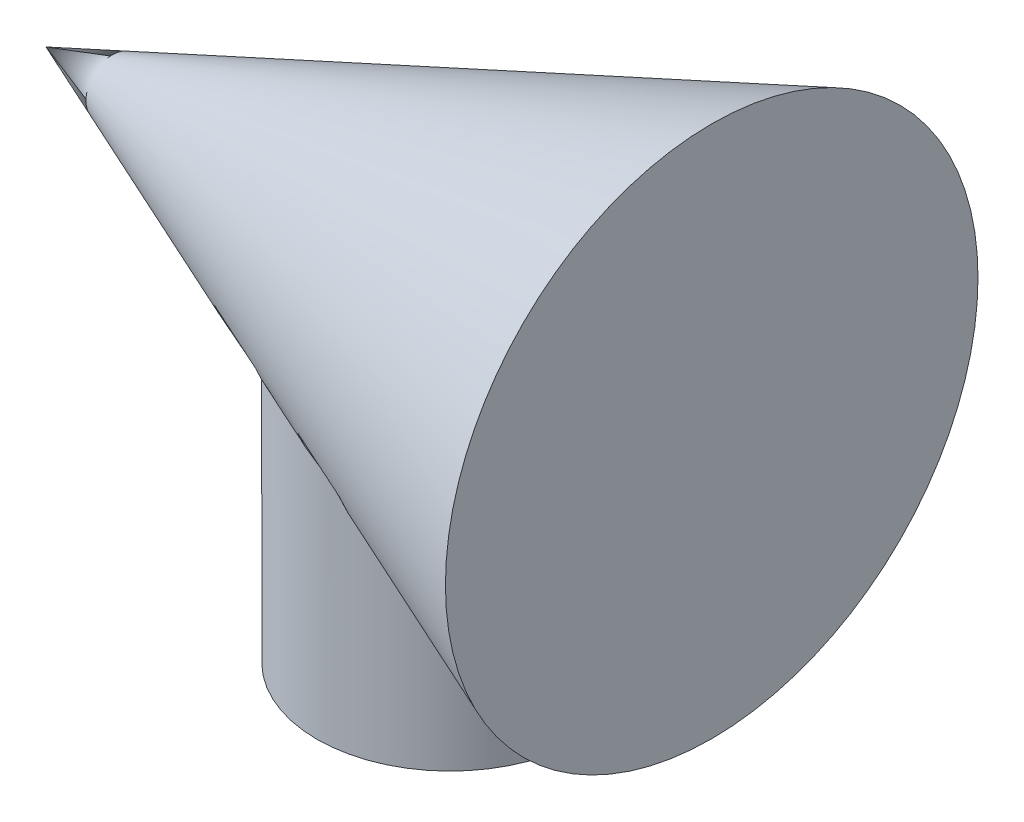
ISO-10303-21;
HEADER;
FILE_DESCRIPTION(('STEP AP214'),'2;1');
FILE_NAME('part.step','',(''),(''),'','','');
FILE_SCHEMA(('AUTOMOTIVE_DESIGN { 1 0 10303 214 1 1 1 1 }'));
ENDSEC;
DATA;
#1=APPLICATION_CONTEXT('core data for automotive mechanical design processes');
#2=APPLICATION_PROTOCOL_DEFINITION('international standard','automotive_design',2000,#1);
#3=PRODUCT_CONTEXT('',#1,'mechanical');
#4=PRODUCT('Part','Part','',(#3));
#5=PRODUCT_RELATED_PRODUCT_CATEGORY('part','',(#4));
#6=PRODUCT_DEFINITION_FORMATION('','',#4);
#7=PRODUCT_DEFINITION_CONTEXT('part definition',#1,'design');
#8=PRODUCT_DEFINITION('design','',#6,#7);
#9=PRODUCT_DEFINITION_SHAPE('','',#8);
#10=(LENGTH_UNIT() NAMED_UNIT(*) SI_UNIT(.MILLI.,.METRE.));
#11=(NAMED_UNIT(*) PLANE_ANGLE_UNIT() SI_UNIT($,.RADIAN.));
#12=(NAMED_UNIT(*) SI_UNIT($,.STERADIAN.) SOLID_ANGLE_UNIT());
#13=UNCERTAINTY_MEASURE_WITH_UNIT(LENGTH_MEASURE(1.E-05),#10,'distance_accuracy_value','');
#14=(GEOMETRIC_REPRESENTATION_CONTEXT(3) GLOBAL_UNCERTAINTY_ASSIGNED_CONTEXT((#13)) GLOBAL_UNIT_ASSIGNED_CONTEXT((#10,
#11,#12)) REPRESENTATION_CONTEXT('',''));
#15=CARTESIAN_POINT('',(0.,0.,0.));
#16=DIRECTION('',(0.,0.,1.));
#17=DIRECTION('',(1.,0.,0.));
#18=AXIS2_PLACEMENT_3D('',#15,#16,#17);
#19=CARTESIAN_POINT('',(-6.21617647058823,0.,0.));
#20=DIRECTION('',(1.,0.,0.));
#21=DIRECTION('',(0.,0.,-1.));
#22=AXIS2_PLACEMENT_3D('',#19,#20,#21);
#23=CONICAL_SURFACE('',#22,20.,0.380506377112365);
#24=CARTESIAN_POINT('',(-35.4471525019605,-7.79282260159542,-2.87893955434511));
#25=CARTESIAN_POINT('',(-35.5196656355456,-7.85101221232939,-2.63772285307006));
#26=CARTESIAN_POINT('',(-35.5835018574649,-7.90275338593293,-2.39228781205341));
#27=CARTESIAN_POINT('',(-35.6927130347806,-7.99173443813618,-1.89463284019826));
#28=CARTESIAN_POINT('',(-35.7380796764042,-8.02896778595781,-1.64240990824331));
#29=CARTESIAN_POINT('',(-35.8094332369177,-8.08769549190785,-1.133267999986));
#30=CARTESIAN_POINT('',(-35.8354100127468,-8.10918161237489,-0.876346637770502));
#31=CARTESIAN_POINT('',(-35.867370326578,-8.13563318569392,-0.360457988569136));
#32=CARTESIAN_POINT('',(-35.8733587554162,-8.14060267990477,-0.101491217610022));
#33=CARTESIAN_POINT('',(-35.8657583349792,-8.13430534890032,0.382205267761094));
#34=CARTESIAN_POINT('',(-35.8546150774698,-8.12506671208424,0.607006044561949));
#35=CARTESIAN_POINT('',(-35.8173105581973,-8.09422519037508,1.05448715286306));
#36=CARTESIAN_POINT('',(-35.7911504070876,-8.07262321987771,1.27716763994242));
#37=CARTESIAN_POINT('',(-35.7242432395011,-8.01761964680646,1.71877858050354));
#38=CARTESIAN_POINT('',(-35.6834995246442,-7.9842207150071,1.9377098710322));
#39=CARTESIAN_POINT('',(-35.5880303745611,-7.90645031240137,2.37050447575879));
#40=CARTESIAN_POINT('',(-35.5333044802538,-7.86207848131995,2.58436762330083));
#41=CARTESIAN_POINT('',(-35.4109096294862,-7.76365887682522,3.004803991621));
#42=CARTESIAN_POINT('',(-35.3433085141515,-7.70966191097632,3.21140898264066));
#43=CARTESIAN_POINT('',(-35.1957101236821,-7.59300177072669,3.61769913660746));
#44=CARTESIAN_POINT('',(-35.1157080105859,-7.53033521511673,3.81738156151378));
#45=CARTESIAN_POINT('',(-34.9440354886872,-7.39763459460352,4.20918696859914));
#46=CARTESIAN_POINT('',(-34.8523618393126,-7.32759848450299,4.40130783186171));
#47=CARTESIAN_POINT('',(-34.6580071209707,-7.18156571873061,4.77756070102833));
#48=CARTESIAN_POINT('',(-34.5553244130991,-7.10556817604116,4.96169151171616));
#49=CARTESIAN_POINT('',(-34.3187427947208,-6.93407442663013,5.35633469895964));
#50=CARTESIAN_POINT('',(-34.1826371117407,-6.83763774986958,5.5651167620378));
#51=CARTESIAN_POINT('',(-33.8961182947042,-6.64119671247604,5.97089987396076));
#52=CARTESIAN_POINT('',(-33.7457016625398,-6.54119148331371,6.16789802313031));
#53=CARTESIAN_POINT('',(-33.4306980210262,-6.34080942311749,6.55020959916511));
#54=CARTESIAN_POINT('',(-33.2661036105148,-6.24043242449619,6.73551683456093));
#55=CARTESIAN_POINT('',(-32.9225975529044,-6.04331348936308,7.09436527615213));
#56=CARTESIAN_POINT('',(-32.7436910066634,-5.94657027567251,7.26791063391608));
#57=CARTESIAN_POINT('',(-32.4362763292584,-5.79422836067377,7.54436465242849));
#58=CARTESIAN_POINT('',(-32.3120953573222,-5.73609809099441,7.6507024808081));
#59=CARTESIAN_POINT('',(-32.0571361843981,-5.62528039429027,7.85830332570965));
#60=CARTESIAN_POINT('',(-31.9263564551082,-5.57259423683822,7.95956515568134));
#61=CARTESIAN_POINT('',(-31.6583105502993,-5.47487041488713,8.15654331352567));
#62=CARTESIAN_POINT('',(-31.5210569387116,-5.42981865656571,8.25226964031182));
#63=CARTESIAN_POINT('',(-31.2399193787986,-5.34969339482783,8.43788988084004));
#64=CARTESIAN_POINT('',(-31.0960400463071,-5.31461306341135,8.5277877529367));
#65=CARTESIAN_POINT('',(-30.8312212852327,-5.26272310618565,8.68390692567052));
#66=CARTESIAN_POINT('',(-30.7114056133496,-5.24366795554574,8.75128297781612));
#67=CARTESIAN_POINT('',(-30.4682527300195,-5.21488586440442,8.88143787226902));
#68=CARTESIAN_POINT('',(-30.3449173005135,-5.20515428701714,8.94421898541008));
#69=CARTESIAN_POINT('',(-30.0955818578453,-5.19603384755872,9.06466057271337));
#70=CARTESIAN_POINT('',(-29.9695856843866,-5.19663097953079,9.12232787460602));
#71=CARTESIAN_POINT('',(-29.7157393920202,-5.2087134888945,9.23219849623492));
#72=CARTESIAN_POINT('',(-29.5878892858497,-5.22019879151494,9.28440185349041));
#73=CARTESIAN_POINT('',(-29.3313656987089,-5.25409165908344,9.3830431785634));
#74=CARTESIAN_POINT('',(-29.2026919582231,-5.27650285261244,9.42947922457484));
#75=CARTESIAN_POINT('',(-28.9455553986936,-5.33171661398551,9.51644220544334));
#76=CARTESIAN_POINT('',(-28.8170926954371,-5.36452368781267,9.55696656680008));
#77=CARTESIAN_POINT('',(-28.4329320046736,-5.47731879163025,9.6698128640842));
#78=CARTESIAN_POINT('',(-28.1787481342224,-5.57163988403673,9.73329917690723));
#79=CARTESIAN_POINT('',(-27.7282763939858,-5.76727956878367,9.82807048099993));
#80=CARTESIAN_POINT('',(-27.5304767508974,-5.86352879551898,9.86324019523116));
#81=CARTESIAN_POINT('',(-27.1402531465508,-6.06994456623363,9.92102196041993));
#82=CARTESIAN_POINT('',(-26.9478329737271,-6.18012063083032,9.94362536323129));
#83=CARTESIAN_POINT('',(-26.5678006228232,-6.41106220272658,9.97749121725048));
#84=CARTESIAN_POINT('',(-26.3802031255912,-6.53185600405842,9.98872230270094));
#85=CARTESIAN_POINT('',(-26.0097716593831,-6.78110908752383,10.0007476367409));
#86=CARTESIAN_POINT('',(-25.8269395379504,-6.90957128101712,10.001537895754));
#87=CARTESIAN_POINT('',(-25.4754013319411,-7.1649785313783,9.99365209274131));
#88=CARTESIAN_POINT('',(-25.306467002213,-7.29162780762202,9.98548726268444));
#89=CARTESIAN_POINT('',(-24.9720648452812,-7.5486748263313,9.96096640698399));
#90=CARTESIAN_POINT('',(-24.8065976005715,-7.6790731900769,9.94460901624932));
#91=CARTESIAN_POINT('',(-24.3147339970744,-8.07448222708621,9.88376725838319));
#92=CARTESIAN_POINT('',(-23.9930288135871,-8.34359324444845,9.82751744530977));
#93=CARTESIAN_POINT('',(-23.3602434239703,-8.887151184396,9.68523034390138));
#94=CARTESIAN_POINT('',(-23.0491792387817,-9.16160525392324,9.59915014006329));
#95=CARTESIAN_POINT('',(-22.4376052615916,-9.71137575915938,9.39779827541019));
#96=CARTESIAN_POINT('',(-22.1370923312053,-9.98669191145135,9.28253537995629));
#97=CARTESIAN_POINT('',(-21.5284973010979,-10.5518560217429,9.01465536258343));
#98=CARTESIAN_POINT('',(-21.2210924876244,-10.8415523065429,8.86017205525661));
#99=CARTESIAN_POINT('',(-20.61931204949,-11.4146528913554,8.51731449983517));
#100=CARTESIAN_POINT('',(-20.3249402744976,-11.6980553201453,8.32893032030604));
#101=CARTESIAN_POINT('',(-19.7521049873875,-12.2538904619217,7.9176318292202));
#102=CARTESIAN_POINT('',(-19.4736013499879,-12.5263502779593,7.69481043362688));
#103=CARTESIAN_POINT('',(-18.9347643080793,-13.0566289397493,7.21288172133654));
#104=CARTESIAN_POINT('',(-18.674418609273,-13.3144576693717,6.9537993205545));
#105=CARTESIAN_POINT('',(-18.2728840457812,-13.7139063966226,6.50598599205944));
#106=CARTESIAN_POINT('',(-18.1246940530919,-13.8617621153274,6.32902227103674));
#107=CARTESIAN_POINT('',(-17.8378029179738,-14.1486866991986,5.96068792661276));
#108=CARTESIAN_POINT('',(-17.6991037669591,-14.287753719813,5.76931429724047));
#109=CARTESIAN_POINT('',(-17.432792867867,-14.5553037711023,5.37230685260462));
#110=CARTESIAN_POINT('',(-17.3051708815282,-14.6837965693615,5.16668652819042));
#111=CARTESIAN_POINT('',(-17.0625658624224,-14.928461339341,4.74127339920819));
#112=CARTESIAN_POINT('',(-16.9475753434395,-15.0446406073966,4.52148911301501));
#113=CARTESIAN_POINT('',(-16.7514819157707,-15.2430280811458,4.10916690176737));
#114=CARTESIAN_POINT('',(-16.6680102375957,-15.3275813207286,3.91888202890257));
#115=CARTESIAN_POINT('',(-16.5118349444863,-15.4859264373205,3.52969753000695));
#116=CARTESIAN_POINT('',(-16.4391260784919,-15.5597235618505,3.33080216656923));
#117=CARTESIAN_POINT('',(-16.3055400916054,-15.6954093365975,2.92515940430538));
#118=CARTESIAN_POINT('',(-16.2446602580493,-15.7573007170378,2.71841381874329));
#119=CARTESIAN_POINT('',(-16.1357612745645,-15.868071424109,2.29813006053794));
#120=CARTESIAN_POINT('',(-16.0877422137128,-15.9169506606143,2.08459184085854));
#121=CARTESIAN_POINT('',(-16.0052004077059,-16.0010038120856,1.65058161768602));
#122=CARTESIAN_POINT('',(-15.9707782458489,-16.0360755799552,1.43007051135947));
#123=CARTESIAN_POINT('',(-15.9166761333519,-16.0912108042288,0.985375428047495));
#124=CARTESIAN_POINT('',(-15.8969962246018,-16.111274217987,0.76119144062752));
#125=CARTESIAN_POINT('',(-15.8728361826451,-16.1359062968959,0.311237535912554));
#126=CARTESIAN_POINT('',(-15.8683503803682,-16.1404807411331,0.0854682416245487));
#127=CARTESIAN_POINT('',(-15.8746709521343,-16.1340360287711,-0.365619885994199));
#128=CARTESIAN_POINT('',(-15.8854759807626,-16.1230182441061,-0.590938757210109));
#129=CARTESIAN_POINT('',(-15.9199878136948,-16.0878370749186,-1.01302921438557));
#130=CARTESIAN_POINT('',(-15.9420520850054,-16.0653473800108,-1.21007957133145));
#131=CARTESIAN_POINT('',(-15.9975406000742,-16.0088102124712,-1.60095712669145));
#132=CARTESIAN_POINT('',(-16.0309685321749,-15.974758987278,-1.79478325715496));
#133=CARTESIAN_POINT('',(-16.1086182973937,-15.8957013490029,-2.1779090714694));
#134=CARTESIAN_POINT('',(-16.1528369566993,-15.8506981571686,-2.3672100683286));
#135=CARTESIAN_POINT('',(-16.2514199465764,-15.7504300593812,-2.74043912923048));
#136=CARTESIAN_POINT('',(-16.3057882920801,-15.6951610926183,-2.92436503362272));
#137=CARTESIAN_POINT('',(-16.4268064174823,-15.5722332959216,-3.29482840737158));
#138=CARTESIAN_POINT('',(-16.4939262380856,-15.5041012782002,-3.48105491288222));
#139=CARTESIAN_POINT('',(-16.63762650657,-15.3583748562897,-3.84603678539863));
#140=CARTESIAN_POINT('',(-16.7142100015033,-15.2807774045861,-4.02478972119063));
#141=CARTESIAN_POINT('',(-16.9568170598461,-15.035234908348,-4.54906247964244));
#142=CARTESIAN_POINT('',(-17.1357329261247,-14.8545033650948,-4.88270320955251));
#143=CARTESIAN_POINT('',(-17.6329561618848,-14.3537595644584,-5.69958337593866));
#144=CARTESIAN_POINT('',(-17.9720763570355,-14.0136045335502,-6.15788799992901));
#145=CARTESIAN_POINT('',(-18.5176148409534,-13.4702948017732,-6.7831857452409));
#146=CARTESIAN_POINT('',(-18.7059494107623,-13.2833387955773,-6.98153735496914));
#147=CARTESIAN_POINT('',(-19.0933414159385,-12.9003954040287,-7.35816616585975));
#148=CARTESIAN_POINT('',(-19.2923985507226,-12.7044082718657,-7.53644392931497));
#149=CARTESIAN_POINT('',(-19.7744122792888,-12.2322288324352,-7.93523609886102));
#150=CARTESIAN_POINT('',(-20.0613749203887,-11.9529721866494,-8.14727600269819));
#151=CARTESIAN_POINT('',(-20.6498954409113,-11.3854602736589,-8.53636149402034));
#152=CARTESIAN_POINT('',(-20.9514597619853,-11.0972010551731,-8.71339145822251));
#153=CARTESIAN_POINT('',(-21.567705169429,-10.5152941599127,-9.03362710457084));
#154=CARTESIAN_POINT('',(-21.8823996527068,-10.2216411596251,-9.17679719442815));
#155=CARTESIAN_POINT('',(-22.5237071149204,-9.63315052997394,-9.42961229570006));
#156=CARTESIAN_POINT('',(-22.850315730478,-9.33831336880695,-9.53926944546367));
#157=CARTESIAN_POINT('',(-23.4327686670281,-8.82491650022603,-9.70177915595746));
#158=CARTESIAN_POINT('',(-23.6859685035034,-8.60565521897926,-9.76197755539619));
#159=CARTESIAN_POINT('',(-24.1998196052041,-8.17125032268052,-9.86292717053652));
#160=CARTESIAN_POINT('',(-24.4604723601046,-7.95610754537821,-9.90367446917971));
#161=CARTESIAN_POINT('',(-24.98942778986,-7.53375065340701,-9.96465688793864));
#162=CARTESIAN_POINT('',(-25.2577091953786,-7.32651766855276,-9.98494420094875));
#163=CARTESIAN_POINT('',(-25.8038053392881,-6.92418582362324,-10.0035079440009));
#164=CARTESIAN_POINT('',(-26.0816126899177,-6.72907787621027,-10.0018010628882));
#165=CARTESIAN_POINT('',(-26.6474895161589,-6.35880707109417,-9.97377833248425));
#166=CARTESIAN_POINT('',(-26.935505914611,-6.18355660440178,-9.94757570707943));
#167=CARTESIAN_POINT('',(-27.5241825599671,-5.86317395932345,-9.8667891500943));
#168=CARTESIAN_POINT('',(-27.8248250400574,-5.71800105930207,-9.81224394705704));
#169=CARTESIAN_POINT('',(-28.3850285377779,-5.49458997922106,-9.68218986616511));
#170=CARTESIAN_POINT('',(-28.6427962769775,-5.40914341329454,-9.61187811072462));
#171=CARTESIAN_POINT('',(-29.031075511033,-5.3118064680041,-9.48838524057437));
#172=CARTESIAN_POINT('',(-29.1606971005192,-5.28450659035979,-9.44424773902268));
#173=CARTESIAN_POINT('',(-29.4196409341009,-5.24079899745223,-9.35001372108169));
#174=CARTESIAN_POINT('',(-29.5489631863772,-5.22439098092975,-9.29991736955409));
#175=CARTESIAN_POINT('',(-29.8063953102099,-5.20270493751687,-9.19393147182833));
#176=CARTESIAN_POINT('',(-29.9345029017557,-5.19744482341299,-9.13803275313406));
#177=CARTESIAN_POINT('',(-30.1882375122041,-5.19774019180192,-9.02091596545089));
#178=CARTESIAN_POINT('',(-30.313864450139,-5.20329602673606,-8.95969772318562));
#179=CARTESIAN_POINT('',(-30.5619764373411,-5.22436275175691,-8.83231627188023));
#180=CARTESIAN_POINT('',(-30.6844557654,-5.23989059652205,-8.76614481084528));
#181=CARTESIAN_POINT('',(-30.9254932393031,-5.27969430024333,-8.62940094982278));
#182=CARTESIAN_POINT('',(-31.0440498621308,-5.30397351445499,-8.55882687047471));
#183=CARTESIAN_POINT('',(-31.3453353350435,-5.37635666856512,-8.37101794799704));
#184=CARTESIAN_POINT('',(-31.5248230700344,-5.43007614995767,-8.25073948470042));
#185=CARTESIAN_POINT('',(-31.8727469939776,-5.55080890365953,-8.00120663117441));
#186=CARTESIAN_POINT('',(-32.0411751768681,-5.61783166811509,-7.87194587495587));
#187=CARTESIAN_POINT('',(-32.3679577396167,-5.76095734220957,-7.60448481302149));
#188=CARTESIAN_POINT('',(-32.5262664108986,-5.83709752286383,-7.4662489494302));
#189=CARTESIAN_POINT('',(-32.8324628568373,-5.99460175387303,-7.18158568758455));
#190=CARTESIAN_POINT('',(-32.980352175,-6.07596502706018,-7.03515950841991));
#191=CARTESIAN_POINT('',(-33.3261842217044,-6.27574069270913,-6.67084297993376));
#192=CARTESIAN_POINT('',(-33.5190529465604,-6.3953575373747,-6.44877334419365));
#193=CARTESIAN_POINT('',(-33.8850023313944,-6.63296021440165,-5.98788822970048));
#194=CARTESIAN_POINT('',(-34.0580735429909,-6.75094524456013,-5.74906484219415));
#195=CARTESIAN_POINT('',(-34.3830320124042,-6.97961650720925,-5.25586363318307));
#196=CARTESIAN_POINT('',(-34.5350116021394,-7.09033335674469,-5.00156110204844));
#197=CARTESIAN_POINT('',(-34.8173103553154,-7.30059538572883,-4.47701585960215));
#198=CARTESIAN_POINT('',(-34.9476488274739,-7.40015049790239,-4.20678765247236));
#199=CARTESIAN_POINT('',(-35.1387674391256,-7.54840913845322,-3.75949509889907));
#200=CARTESIAN_POINT('',(-35.2068806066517,-7.60182730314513,-3.58708935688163));
#201=CARTESIAN_POINT('',(-35.3340002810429,-7.70230833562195,-3.23689051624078));
#202=CARTESIAN_POINT('',(-35.3929962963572,-7.74936387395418,-3.05909148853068));
#203=CARTESIAN_POINT('',(-35.4471525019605,-7.79282260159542,-2.87893955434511));
#204=B_SPLINE_CURVE_WITH_KNOTS('',3,(#24,#25,#26,#27,#28,#29,#30,#31,#32,#33,#34,#35,#36,#37,
#38,#39,#40,#41,#42,#43,#44,#45,#46,#47,#48,#49,#50,#51,#52,#53,#54,#55,#56,#57,#58,#59,#60,#61,
#62,#63,#64,#65,#66,#67,#68,#69,#70,#71,#72,#73,#74,#75,#76,#77,#78,#79,#80,#81,#82,#83,#84,#85,
#86,#87,#88,#89,#90,#91,#92,#93,#94,#95,#96,#97,#98,#99,#100,#101,#102,#103,#104,#105,#106,#107,
#108,#109,#110,#111,#112,#113,#114,#115,#116,#117,#118,#119,#120,#121,#122,#123,#124,#125,#126,
#127,#128,#129,#130,#131,#132,#133,#134,#135,#136,#137,#138,#139,#140,#141,#142,#143,#144,#145,
#146,#147,#148,#149,#150,#151,#152,#153,#154,#155,#156,#157,#158,#159,#160,#161,#162,#163,#164,
#165,#166,#167,#168,#169,#170,#171,#172,#173,#174,#175,#176,#177,#178,#179,#180,#181,#182,#183,
#184,#185,#186,#187,#188,#189,#190,#191,#192,#193,#194,#195,#196,#197,#198,#199,#200,#201,#202,
#203),.UNSPECIFIED.,.T.,.F.,(4,2,2,2,2,2,2,2,2,2,2,2,2,2,2,2,2,2,2,2,2,2,2,2,2,2,2,2,2,2,2,2,2,
2,2,2,2,2,2,2,2,2,2,2,2,2,2,2,2,2,2,2,2,2,2,2,2,2,2,2,2,2,2,2,2,2,2,2,2,2,2,2,2,2,2,2,2,2,2,2,2,
2,2,2,2,2,2,2,2,4),(0.,0.77533823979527,1.55102510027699,2.32711744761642,3.10301988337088,
3.77797964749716,4.4528894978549,5.12764664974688,5.80242595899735,6.47374350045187,
7.14532360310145,7.81709057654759,8.48895769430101,9.28994107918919,10.0911207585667,
10.8927212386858,11.6940372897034,12.2143522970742,12.7347883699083,13.2542529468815,
13.7733609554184,14.1893022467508,14.6050365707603,15.0202071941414,15.4353749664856,
15.8506807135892,16.2661667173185,17.0980552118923,17.7654907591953,18.4333850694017,
19.1031165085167,19.7731038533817,20.4067436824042,21.0404891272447,22.3085500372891,
23.5784428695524,24.8479547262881,26.1958076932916,27.5440561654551,28.8887284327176,
30.2324812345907,31.0542387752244,31.8761682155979,32.6973296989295,33.5180018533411,
34.1903790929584,34.8624271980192,35.5343210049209,36.2062194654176,36.8829991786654,
37.5597808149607,38.2363099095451,38.9127794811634,39.5107551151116,40.1089250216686,
40.7069192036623,41.3051504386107,41.9325909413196,42.5602339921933,43.8151679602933,
45.7951285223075,46.7884308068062,47.7817052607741,49.1390997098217,50.4970985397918,
51.8565185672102,53.2154456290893,54.2357820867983,55.2563239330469,56.2742557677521,
57.2914152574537,58.3038963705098,59.3149976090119,60.1527573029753,60.5711492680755,
60.989529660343,61.4085818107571,61.8276476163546,62.2474278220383,62.6673691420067,
63.3341474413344,64.0014032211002,64.6714862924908,65.3414698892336,66.2929257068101,
67.2448337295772,68.1924334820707,69.1391831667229,69.7175813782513,70.2966403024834),.UNSPECIFIED.);
#205=CARTESIAN_POINT('',(-35.4471525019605,-7.79282260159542,-2.87893955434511));
#206=VERTEX_POINT('',#205);
#207=EDGE_CURVE('E35',#206,#206,#204,.T.);
#208=ORIENTED_EDGE('',*,*,#207,.T.);
#209=EDGE_LOOP('',(#208));
#210=FACE_BOUND('',#209,.T.);
#211=CARTESIAN_POINT('',(-56.2161764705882,0.,0.));
#212=VERTEX_POINT('',#211);
#213=VERTEX_LOOP('',#212);
#214=FACE_BOUND('',#213,.T.);
#215=CARTESIAN_POINT('',(-6.21617647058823,0.,0.));
#216=DIRECTION('',(-1.,0.,0.));
#217=DIRECTION('',(0.,0.,1.));
#218=AXIS2_PLACEMENT_3D('',#215,#216,#217);
#219=CIRCLE('',#218,20.);
#220=CARTESIAN_POINT('',(-6.21617647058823,0.,20.));
#221=VERTEX_POINT('',#220);
#222=EDGE_CURVE('E11',#221,#221,#219,.T.);
#223=ORIENTED_EDGE('',*,*,#222,.T.);
#224=EDGE_LOOP('',(#223));
#225=FACE_BOUND('',#224,.T.);
#226=ADVANCED_FACE('F31',(#210,#214,#225),#23,.T.);
#227=CARTESIAN_POINT('',(-6.21617647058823,20.,0.));
#228=DIRECTION('',(-1.,0.,0.));
#229=DIRECTION('',(0.,0.,1.));
#230=AXIS2_PLACEMENT_3D('',#227,#228,#229);
#231=PLANE('',#230);
#232=ORIENTED_EDGE('',*,*,#222,.F.);
#233=EDGE_LOOP('',(#232));
#234=FACE_BOUND('',#233,.T.);
#235=ADVANCED_FACE('F46',(#234),#231,.F.);
#236=CARTESIAN_POINT('',(-25.8705295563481,1.18514901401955,0.));
#237=DIRECTION('',(0.,1.,0.));
#238=DIRECTION('',(0.,0.,1.));
#239=AXIS2_PLACEMENT_3D('',#236,#237,#238);
#240=CYLINDRICAL_SURFACE('',#239,10.0000000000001);
#241=CARTESIAN_POINT('',(-25.8705295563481,-24.8619469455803,0.));
#242=DIRECTION('',(0.,1.,0.));
#243=DIRECTION('',(0.,0.,1.));
#244=AXIS2_PLACEMENT_3D('',#241,#242,#243);
#245=CIRCLE('',#244,10.0000000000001);
#246=CARTESIAN_POINT('',(-25.8705295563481,-24.8619469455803,10.0000000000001));
#247=VERTEX_POINT('',#246);
#248=EDGE_CURVE('E65',#247,#247,#245,.T.);
#249=ORIENTED_EDGE('',*,*,#248,.T.);
#250=EDGE_LOOP('',(#249));
#251=FACE_BOUND('',#250,.T.);
#252=ORIENTED_EDGE('',*,*,#207,.F.);
#253=EDGE_LOOP('',(#252));
#254=FACE_BOUND('',#253,.T.);
#255=ADVANCED_FACE('F51',(#251,#254),#240,.T.);
#256=CARTESIAN_POINT('',(-35.8705295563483,-24.8619469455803,0.));
#257=DIRECTION('',(0.,-1.,0.));
#258=DIRECTION('',(0.,0.,-1.));
#259=AXIS2_PLACEMENT_3D('',#256,#257,#258);
#260=PLANE('',#259);
#261=ORIENTED_EDGE('',*,*,#248,.F.);
#262=EDGE_LOOP('',(#261));
#263=FACE_BOUND('',#262,.T.);
#264=ADVANCED_FACE('F55',(#263),#260,.T.);
#265=CLOSED_SHELL('',(#226,#235,#255,#264));
#266=MANIFOLD_SOLID_BREP('B2',#265);
#267=ADVANCED_BREP_SHAPE_REPRESENTATION('',(#18,#266),#14);
#268=SHAPE_DEFINITION_REPRESENTATION(#9,#267);
ENDSEC;
END-ISO-10303-21;
